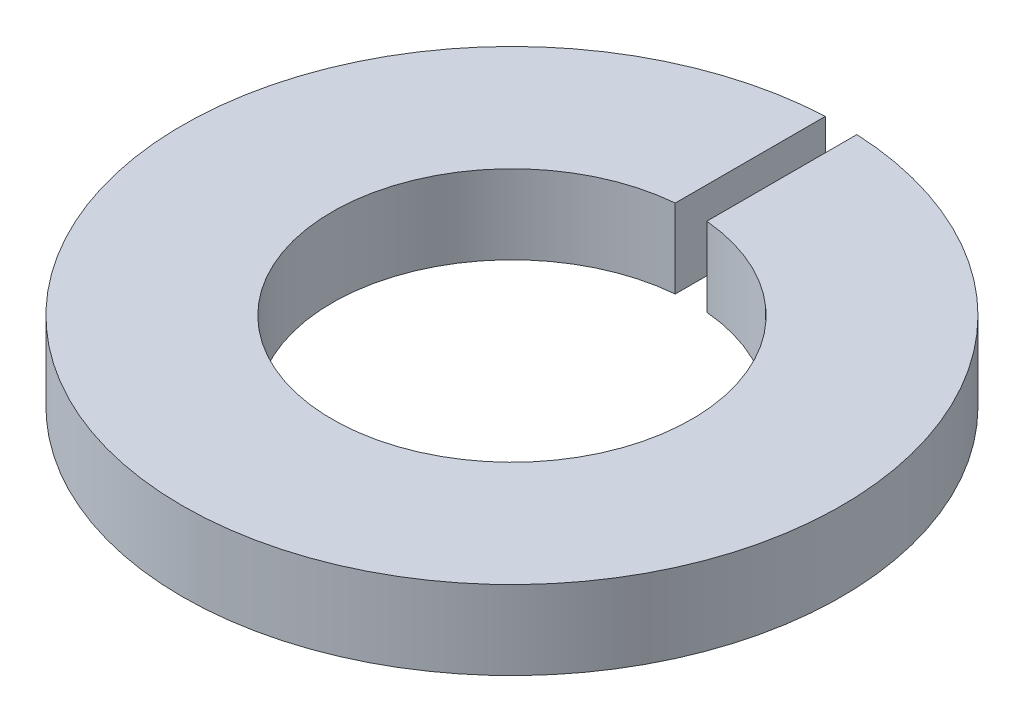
from build123d import *

# Parameters (mm, degrees)
SKETCH1_R          = 2.6543
SKETCH1_R_2        = 1.4478
EXTRUDE1_DEPTH     = 0.635
SKETCH2_W          = 0.254
SKETCH2_H          = 2.6543
CUT_EXTRUDE1_DEPTH = 4.807077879


with BuildPart() as part:
    # Sketch1 → Extrude1 (new body)
    with BuildSketch(Plane(origin=(0, 0, 0), x_dir=(1, 0, 0), z_dir=(0, 1, 0))):
        with Locations(Location((0, 0, 0), (0, 0, 270))):
            Circle(SKETCH1_R)
        with Locations(Location((0, 0, 0), (0, 0, 270))):
            Circle(SKETCH1_R_2, mode=Mode.SUBTRACT)
    extrude(amount=EXTRUDE1_DEPTH)

    # Sketch2 → Cut-Extrude1 (cut, through all)
    with BuildSketch(Plane(origin=(0, 0, 0), x_dir=(1, 0, 0), z_dir=(0, 1, 0))):
        with Locations((0, 1.32715)):
            Rectangle(SKETCH2_W, SKETCH2_H)
    extrude(amount=CUT_EXTRUDE1_DEPTH, mode=Mode.SUBTRACT)


solid = part.part
